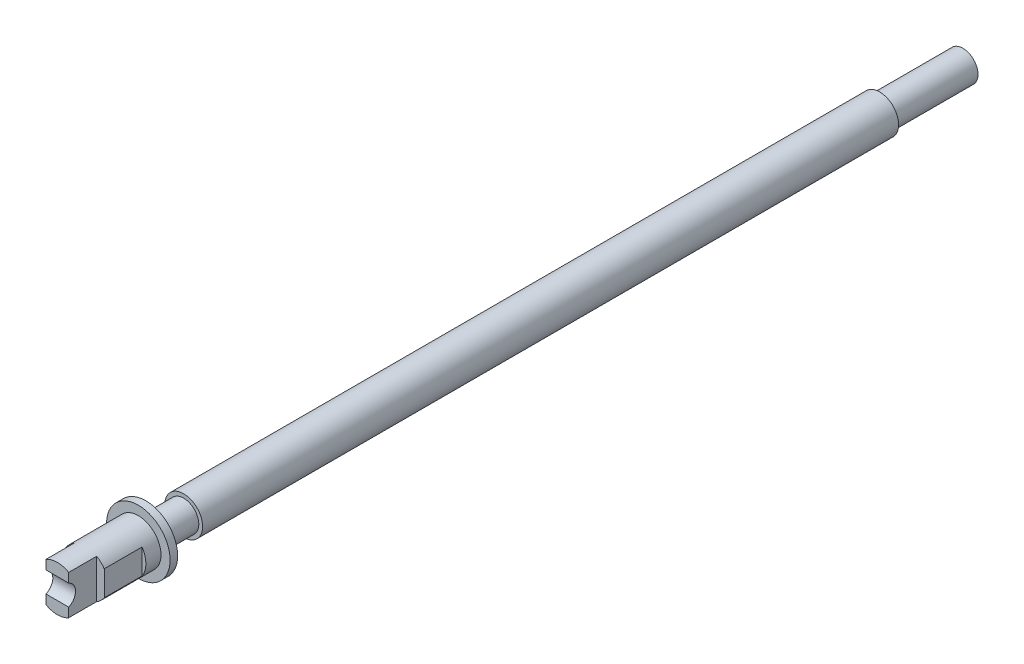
from build123d import *

# Parameters (mm, degrees)
SKETCH_1_R          = 1.8
EXTRUDE_1_DEPTH     = 5
SKETCH_2_R          = 2
EXTRUDE_2_DEPTH     = 30
SKETCH_3_R          = 2.5
EXTRUDE_3_DEPTH     = 92
SKETCH_4_R          = 2
EXTRUDE_4_DEPTH     = 5
SKETCH_5_R          = 4.2
EXTRUDE_5_DEPTH     = 1
SKETCH_6_R          = 3
EXTRUDE_6_DEPTH     = 10.7
CUT_EXTRUDE_START   = -8.7
CUT_EXTRUDE_1_DEPTH = 8.7
CUT_EXTRUDE_START_2 = -3.7
CUT_EXTRUDE_2_DEPTH = 3.7
SKETCH_9_R          = 3.867552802
CUT_EXTRUDE_3_DEPTH = 24
CUT_EXTRUDE_4_DEPTH = 10


with BuildPart() as part:
    # Sketch 1 → Extrude 1 (new body)
    with BuildSketch(Plane.XY):
        Circle(SKETCH_1_R)
    extrude(amount=EXTRUDE_1_DEPTH)

    # Sketch 2 → Extrude 2 (add)
    with BuildSketch(Plane.XY.offset(5)):
        Circle(SKETCH_2_R)
    extrude(amount=EXTRUDE_2_DEPTH)

    # Sketch 3 → Extrude 3 (add)
    with BuildSketch(Plane.XY.offset(35)):
        Circle(SKETCH_3_R)
    extrude(amount=EXTRUDE_3_DEPTH)

    # Sketch 4 → Extrude 4 (add)
    with BuildSketch(Plane.XY.offset(127)):
        Circle(SKETCH_4_R)
    extrude(amount=EXTRUDE_4_DEPTH)

    # Sketch 5 → Extrude 5 (add)
    with BuildSketch(Plane.XY.offset(132)):
        Circle(SKETCH_5_R)
    extrude(amount=EXTRUDE_5_DEPTH)

    # Sketch 6 → Extrude 6 (add)
    with BuildSketch(Plane.XY.offset(133)):
        Circle(SKETCH_6_R)
    extrude(amount=EXTRUDE_6_DEPTH)

    # Sketch 7 → Cut-Extrude 1 (cut)
    with BuildSketch(Plane.XY.offset(143.7).offset(CUT_EXTRUDE_START)):
        with BuildLine():
            Line((2.5, 1.658312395), (2.5, 0))
            Line((2.5, 0), (2.5, -1.658312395))
            ThreePointArc((2.5, -1.658312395), (2.872281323, -0.866025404), (3, 0))
            ThreePointArc((3, 0), (2.872281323, 0.866025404), (2.5, 1.658312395))
        make_face()
    extrude(amount=CUT_EXTRUDE_1_DEPTH, mode=Mode.SUBTRACT)

    # Sketch 8 → Cut-Extrude 2 (cut)
    with BuildSketch(Plane.XY.offset(143.7).offset(CUT_EXTRUDE_START_2)):
        with BuildLine():
            Line((-1.5, -2.598076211), (-1.5, 2.598076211))
            ThreePointArc((-1.5, 2.598076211), (-3, 0), (-1.5, -2.598076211))
        make_face()
        with BuildLine():
            ThreePointArc((2.5, 1.658312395), (2.054455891, 2.186140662), (1.5, 2.598076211))
            Line((1.5, 2.598076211), (1.5, -2.598076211))
            ThreePointArc((1.5, -2.598076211), (2.054455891, -2.186140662), (2.5, -1.658312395))
            Line((2.5, -1.658312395), (2.5, 1.658312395))
        make_face()
    extrude(amount=CUT_EXTRUDE_2_DEPTH, mode=Mode.SUBTRACT)

    # Sketch 9 → Cut-Extrude 3 (cut)
    with BuildSketch(Plane(origin=(0, 0, 0), x_dir=(-1, 0, 0), z_dir=(0, 0, -1))):
        Circle(SKETCH_9_R)
    extrude(amount=-CUT_EXTRUDE_3_DEPTH, mode=Mode.SUBTRACT)

    # Sketch 10 → Cut-Extrude 4 (cut)
    with BuildSketch(Plane(origin=(2.5, 0, 0), x_dir=(0, 0, -1), z_dir=(1, 0, 0))):
        with BuildLine():
            ThreePointArc((-145.8, 0), (-144.3, -1.5), (-142.8, 0))
            Line((-142.8, 0), (-145.8, 0))
        make_face()
        with BuildLine():
            Line((-145.8, 0), (-142.8, 0))
            ThreePointArc((-142.8, 0), (-144.3, 1.5), (-145.8, 0))
        make_face()
        with BuildLine():
            ThreePointArc((-145.8, 0), (-144.3, -1.5), (-142.8, 0))
            Line((-142.8, 0), (-145.8, 0))
        make_face()
        with BuildLine():
            Line((-145.8, 0), (-142.8, 0))
            ThreePointArc((-142.8, 0), (-144.3, 1.5), (-145.8, 0))
        make_face()
    extrude(amount=-CUT_EXTRUDE_4_DEPTH, mode=Mode.SUBTRACT)


solid = part.part
